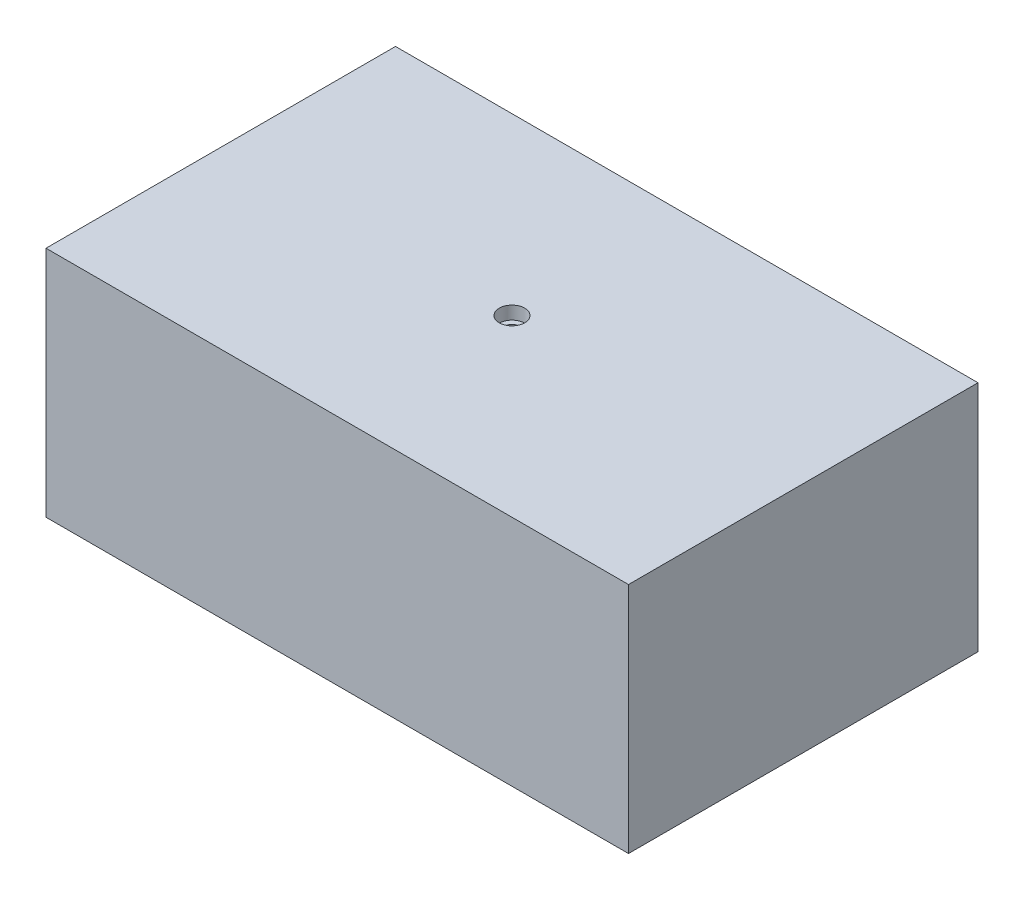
from build123d import *

# Parameters (mm, degrees)
SKETCH1_W                                      = 127
SKETCH1_H                                      = 76.2
BOSS_EXTRUDE1_DEPTH                            = 50.8
CBORE_FOR_4_SOCKET_HEAD_CAP_SCREW1_D           = 3.2639
CBORE_FOR_4_SOCKET_HEAD_CAP_SCREW1_CBORE_D     = 5.55752
CBORE_FOR_4_SOCKET_HEAD_CAP_SCREW1_CBORE_DEPTH = 2.8448


with BuildPart() as part:
    # Sketch1 → Boss-Extrude1 (new body)
    with BuildSketch(Plane(origin=(0, 0, 0), x_dir=(1, 0, 0), z_dir=(0, 1, 0))):
        Rectangle(SKETCH1_W, SKETCH1_H)
    extrude(amount=BOSS_EXTRUDE1_DEPTH)

    # CBORE for _4 Socket Head Cap Screw1 (through all)
    with Locations(Plane(origin=(0, 50.8, 0), x_dir=(1, 0, 0), z_dir=(0, 1, 0))):
        with Locations((0, 0)):
            CounterBoreHole(CBORE_FOR_4_SOCKET_HEAD_CAP_SCREW1_D / 2, CBORE_FOR_4_SOCKET_HEAD_CAP_SCREW1_CBORE_D / 2, CBORE_FOR_4_SOCKET_HEAD_CAP_SCREW1_CBORE_DEPTH)


solid = part.part
